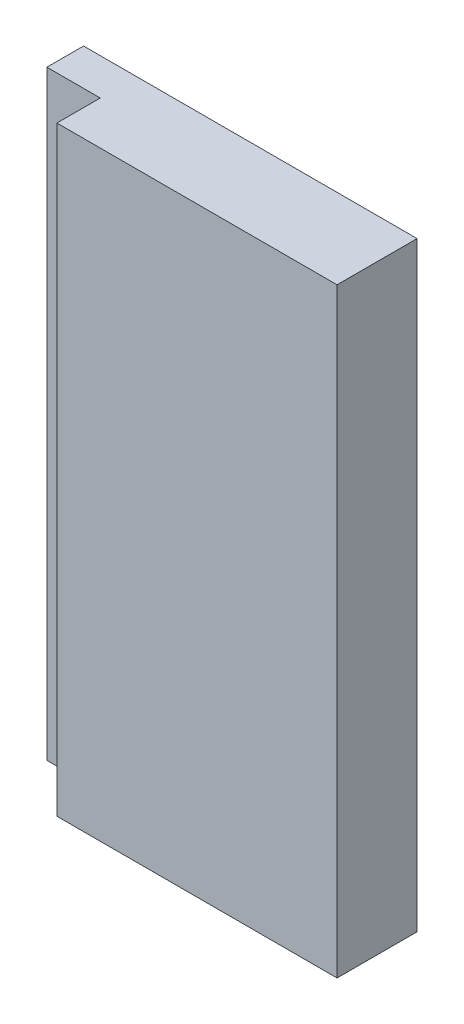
from build123d import *

# Parameters (mm, degrees)
ESQUISSE1_W             = 25
ESQUISSE1_H             = 45
EXTRUSION1_DEPTH        = 6
ESQUISSE2_W             = 4
ESQUISSE2_H             = 45
ENL_V_MAT_EXTRU_1_DEPTH = 3.25


with BuildPart() as part:
    # Esquisse1 → Extrusion1 (new body)
    with BuildSketch(Plane.XY):
        with Locations((32.5, 17.5)):
            Rectangle(ESQUISSE1_W, ESQUISSE1_H)
    extrude(amount=EXTRUSION1_DEPTH)

    # Esquisse2 → Enl_v. mat.-Extru.1 (cut)
    with BuildSketch(Plane.XY.offset(6)):
        with Locations((22, 17.5)):
            Rectangle(ESQUISSE2_W, ESQUISSE2_H)
    extrude(amount=-ENL_V_MAT_EXTRU_1_DEPTH, mode=Mode.SUBTRACT)


solid = part.part
